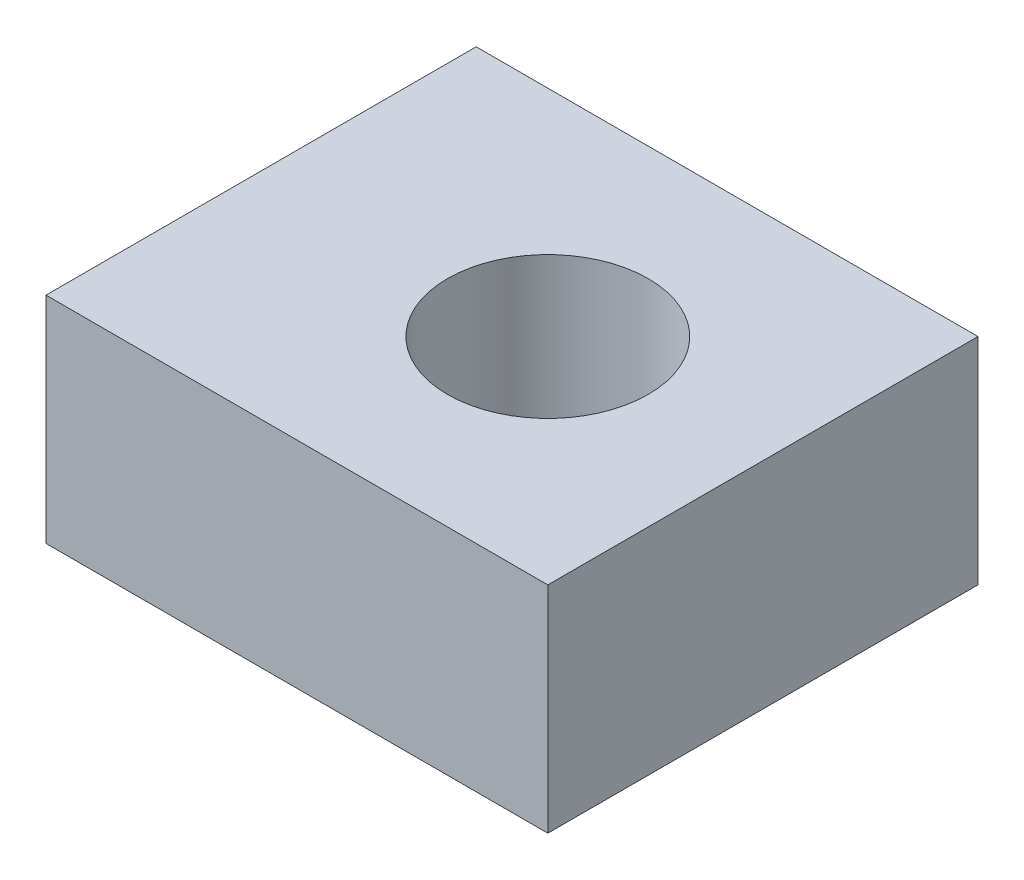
from build123d import *

# Parameters (mm, degrees)
ESQUISSE1_W                = 35
ESQUISSE1_H                = 15
EXTRUSION1_DEPTH           = 30
TROU_TARAUD_M16X2_01_D     = 14
TROU_TARAUD_M16X2_01_DEPTH = 38
TROU_TARAUD_M16X2_01_TIP   = 4.206024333


with BuildPart() as part:
    # Esquisse1 → Extrusion1 (new body)
    with BuildSketch(Plane.XY):
        with Locations((17.5, 7.5)):
            Rectangle(ESQUISSE1_W, ESQUISSE1_H)
    extrude(amount=EXTRUSION1_DEPTH)

    # Trou taraud_ M16x2.01
    with Locations(Plane(origin=(0, 15, 0), x_dir=(-1, 0, 0), z_dir=(0, 1, 0))):
        with Locations((-20, 15)):
            Hole(TROU_TARAUD_M16X2_01_D / 2, depth=TROU_TARAUD_M16X2_01_DEPTH)
            with Locations((0, 0, -(TROU_TARAUD_M16X2_01_DEPTH + TROU_TARAUD_M16X2_01_TIP / 2))):  # 118° drill point
                Cone(0, TROU_TARAUD_M16X2_01_D / 2, TROU_TARAUD_M16X2_01_TIP, mode=Mode.SUBTRACT)


solid = part.part
